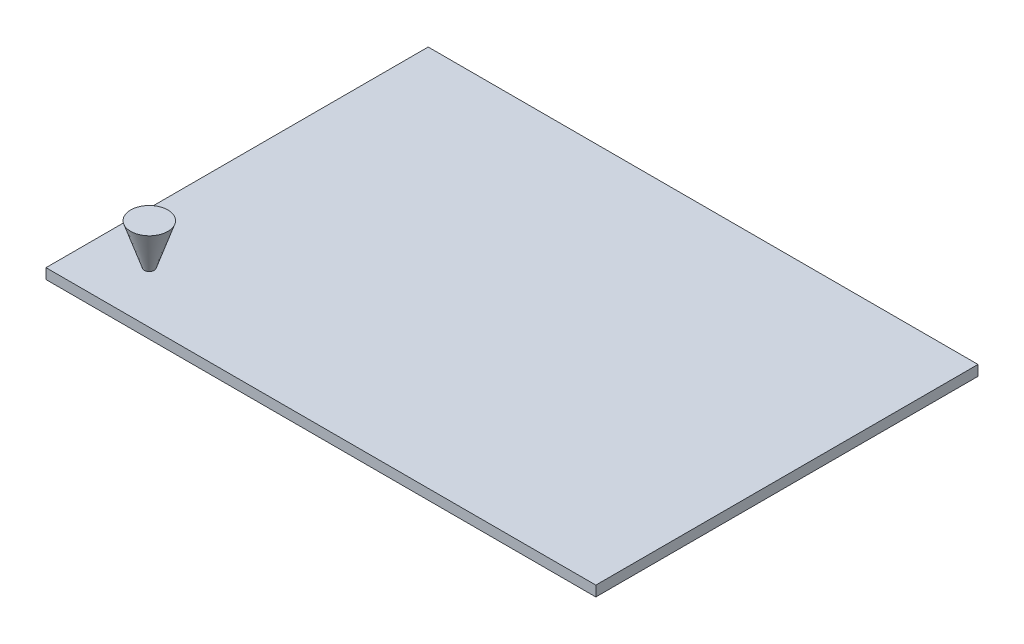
from build123d import *

# Parameters (mm, degrees)
SKETCH1_W      = 135.20354144
SKETCH1_H      = 93.979805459
EXTRUDE1_DEPTH = 2.54


with BuildPart() as part:
    # Sketch1 → Extrude1 (new body)
    with BuildSketch(Plane(origin=(0, 0, 0), x_dir=(1, 0, 0), z_dir=(0, 1, 0))):
        with Locations((54.90177072, 34.289902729)):
            Rectangle(SKETCH1_W, SKETCH1_H)
    extrude(amount=EXTRUDE1_DEPTH)


with BuildPart() as body_2:
    # Sketch2 → Revolve1 (revolve)
    with BuildSketch(Plane.XY, mode=Mode.PRIVATE) as revolve1_sk:
        Polygon((0, 12.548744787), (4.568563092, 12.548744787), (0.936430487, 1.749460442), (0, 1.749460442), align=None)
    revolve(revolve1_sk.sketch.rotate(Axis((0, 1.749460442, 0), (0, 1, 0)), 270), axis=Axis((0, 1.749460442, 0), (0, 1, 0)))


solid = Compound([part.part, body_2.part])
